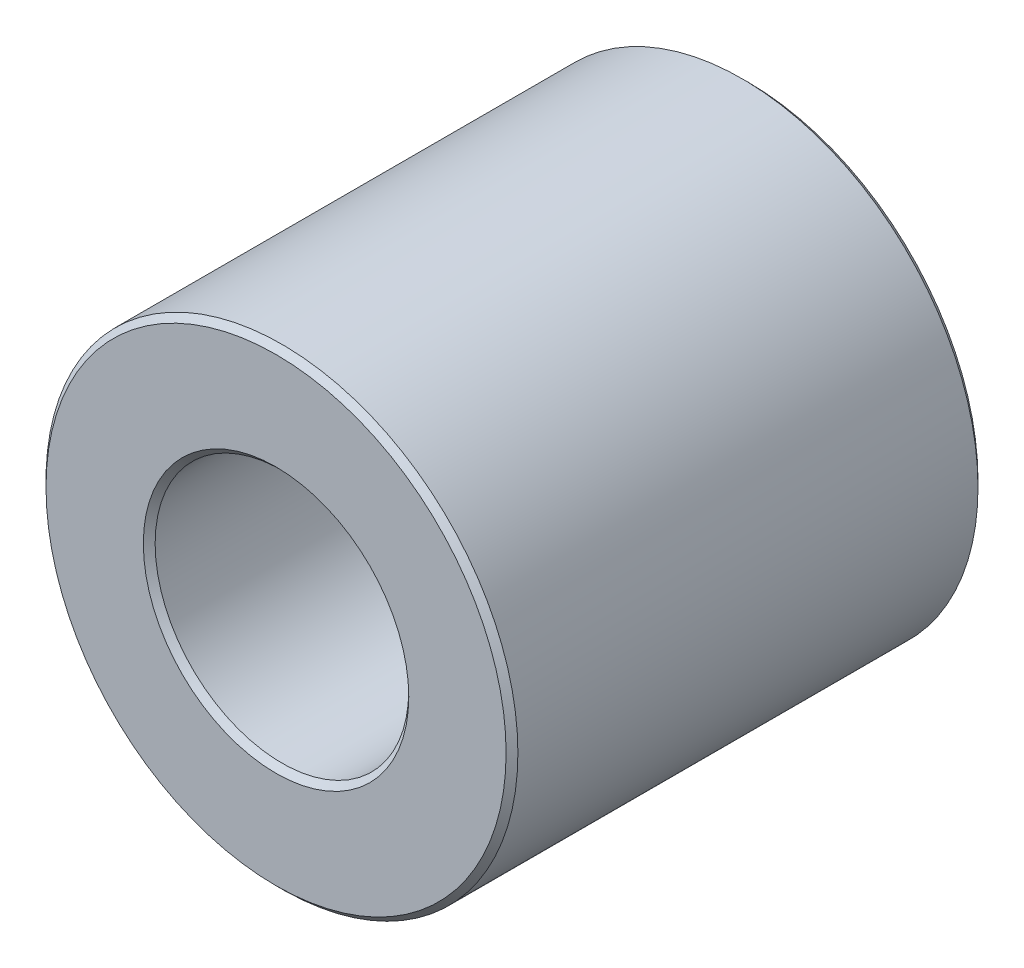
from build123d import *

# Parameters (mm, degrees)
SKETCH1_R           = 4
SKETCH1_R_2         = 2.15
BOSS_EXTRUDE2_DEPTH = 4
CHAMFER3_SIZE       = 0.1


with BuildPart() as part:
    # Sketch1 → Boss-Extrude2 (new, symmetric)
    with BuildSketch(Plane.XY):
        Circle(SKETCH1_R)
        Circle(SKETCH1_R_2, mode=Mode.SUBTRACT)
    extrude(amount=BOSS_EXTRUDE2_DEPTH, both=True)

    # Chamfer3
    chamfer3_edges = [part.edges().sort_by_distance(p)[0] for p in [
        (-4, 0, -4),
        (-4, 0, 4),
        (-2.15, 0, -4),
        (-2.15, 0, 4),
    ]]
    chamfer(chamfer3_edges, length=CHAMFER3_SIZE)


solid = part.part
